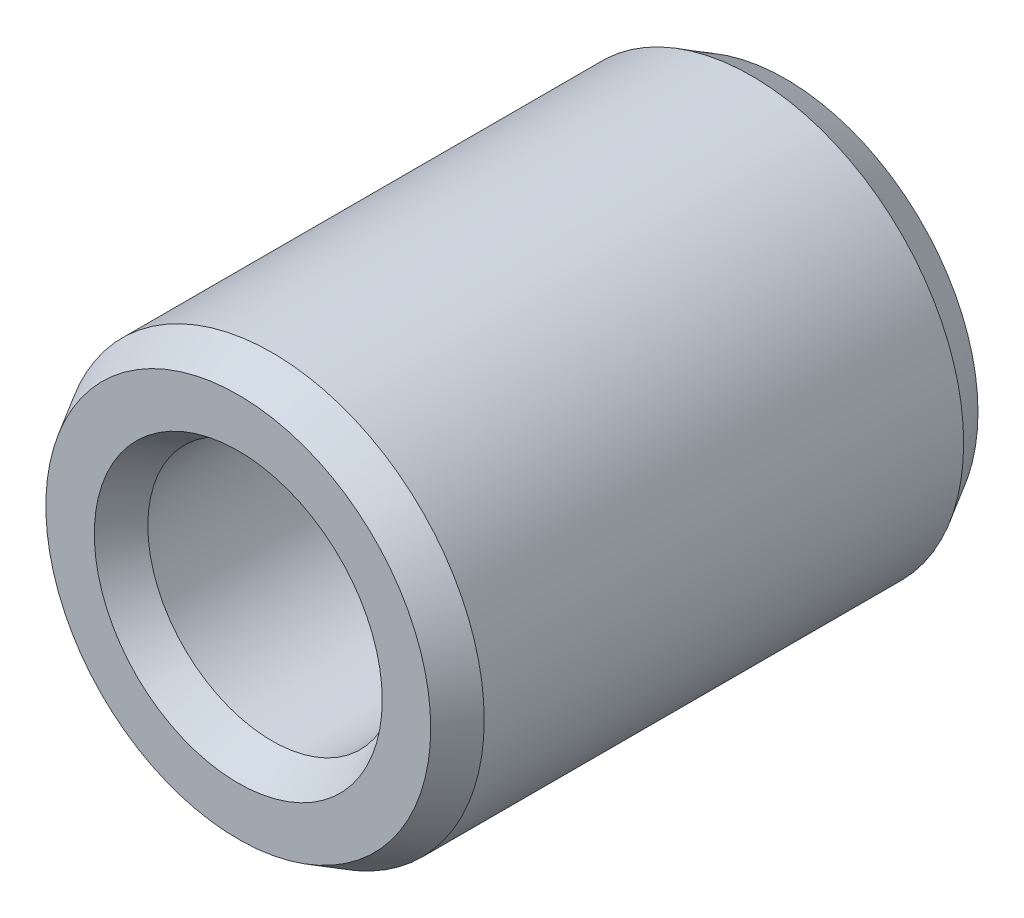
ISO-10303-21;
HEADER;
FILE_DESCRIPTION(('STEP AP214'),'2;1');
FILE_NAME('part.step','',(''),(''),'','','');
FILE_SCHEMA(('AUTOMOTIVE_DESIGN { 1 0 10303 214 1 1 1 1 }'));
ENDSEC;
DATA;
#1=APPLICATION_CONTEXT('core data for automotive mechanical design processes');
#2=APPLICATION_PROTOCOL_DEFINITION('international standard','automotive_design',2000,#1);
#3=PRODUCT_CONTEXT('',#1,'mechanical');
#4=PRODUCT('Part','Part','',(#3));
#5=PRODUCT_RELATED_PRODUCT_CATEGORY('part','',(#4));
#6=PRODUCT_DEFINITION_FORMATION('','',#4);
#7=PRODUCT_DEFINITION_CONTEXT('part definition',#1,'design');
#8=PRODUCT_DEFINITION('design','',#6,#7);
#9=PRODUCT_DEFINITION_SHAPE('','',#8);
#10=(LENGTH_UNIT() NAMED_UNIT(*) SI_UNIT(.MILLI.,.METRE.));
#11=(NAMED_UNIT(*) PLANE_ANGLE_UNIT() SI_UNIT($,.RADIAN.));
#12=(NAMED_UNIT(*) SI_UNIT($,.STERADIAN.) SOLID_ANGLE_UNIT());
#13=UNCERTAINTY_MEASURE_WITH_UNIT(LENGTH_MEASURE(1.E-05),#10,'distance_accuracy_value','');
#14=(GEOMETRIC_REPRESENTATION_CONTEXT(3) GLOBAL_UNCERTAINTY_ASSIGNED_CONTEXT((#13)) GLOBAL_UNIT_ASSIGNED_CONTEXT((#10,
#11,#12)) REPRESENTATION_CONTEXT('',''));
#15=CARTESIAN_POINT('',(0.,0.,0.));
#16=DIRECTION('',(0.,0.,1.));
#17=DIRECTION('',(1.,0.,0.));
#18=AXIS2_PLACEMENT_3D('',#15,#16,#17);
#19=CARTESIAN_POINT('',(0.,0.,12.2936));
#20=DIRECTION('',(0.,0.,1.));
#21=DIRECTION('',(1.,0.,0.));
#22=AXIS2_PLACEMENT_3D('',#19,#20,#21);
#23=PLANE('',#22);
#24=CARTESIAN_POINT('',(0.,0.,12.2936));
#25=DIRECTION('',(0.,0.,1.));
#26=DIRECTION('',(1.,0.,0.));
#27=AXIS2_PLACEMENT_3D('',#24,#25,#26);
#28=CIRCLE('',#27,3.2339409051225);
#29=CARTESIAN_POINT('',(3.2339409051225,0.,12.2936));
#30=VERTEX_POINT('',#29);
#31=EDGE_CURVE('E39',#30,#30,#28,.F.);
#32=ORIENTED_EDGE('',*,*,#31,.T.);
#33=EDGE_LOOP('',(#32));
#34=FACE_BOUND('',#33,.T.);
#35=CARTESIAN_POINT('',(0.,0.,12.2936));
#36=DIRECTION('',(0.,0.,1.));
#37=DIRECTION('',(1.,0.,0.));
#38=AXIS2_PLACEMENT_3D('',#35,#36,#37);
#39=CIRCLE('',#38,4.3225590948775);
#40=CARTESIAN_POINT('',(4.3225590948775,0.,12.2936));
#41=VERTEX_POINT('',#40);
#42=EDGE_CURVE('E43',#41,#41,#39,.T.);
#43=ORIENTED_EDGE('',*,*,#42,.T.);
#44=EDGE_LOOP('',(#43));
#45=FACE_BOUND('',#44,.T.);
#46=ADVANCED_FACE('F28',(#34,#45),#23,.T.);
#47=CARTESIAN_POINT('',(1.55431223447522E-12,1.11022302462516E-12,0.));
#48=DIRECTION('',(0.,0.,1.));
#49=DIRECTION('',(1.,0.,0.));
#50=AXIS2_PLACEMENT_3D('',#47,#48,#49);
#51=PLANE('',#50);
#52=CARTESIAN_POINT('',(1.55431223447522E-12,1.11022302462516E-12,0.));
#53=DIRECTION('',(0.,0.,1.));
#54=DIRECTION('',(1.,0.,0.));
#55=AXIS2_PLACEMENT_3D('',#52,#53,#54);
#56=CIRCLE('',#55,3.2339409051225);
#57=CARTESIAN_POINT('',(3.23394090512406,1.10583600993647E-12,0.));
#58=VERTEX_POINT('',#57);
#59=EDGE_CURVE('E54',#58,#58,#56,.T.);
#60=ORIENTED_EDGE('',*,*,#59,.T.);
#61=EDGE_LOOP('',(#60));
#62=FACE_BOUND('',#61,.T.);
#63=CARTESIAN_POINT('',(1.55431223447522E-12,1.11022302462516E-12,0.));
#64=DIRECTION('',(0.,0.,1.));
#65=DIRECTION('',(1.,0.,0.));
#66=AXIS2_PLACEMENT_3D('',#63,#64,#65);
#67=CIRCLE('',#66,4.3225590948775);
#68=CARTESIAN_POINT('',(4.32255909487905,1.1043592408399E-12,0.));
#69=VERTEX_POINT('',#68);
#70=EDGE_CURVE('E57',#69,#69,#67,.F.);
#71=ORIENTED_EDGE('',*,*,#70,.T.);
#72=EDGE_LOOP('',(#71));
#73=FACE_BOUND('',#72,.T.);
#74=ADVANCED_FACE('F61',(#62,#73),#51,.F.);
#75=CARTESIAN_POINT('',(0.,0.,12.2936));
#76=DIRECTION('',(0.,0.,-1.));
#77=DIRECTION('',(-1.,0.,0.));
#78=AXIS2_PLACEMENT_3D('',#75,#76,#77);
#79=CYLINDRICAL_SURFACE('',#78,4.7625);
#80=CARTESIAN_POINT('',(1.11022302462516E-12,0.,0.761999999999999));
#81=DIRECTION('',(0.,0.,1.));
#82=DIRECTION('',(1.,0.,0.));
#83=AXIS2_PLACEMENT_3D('',#80,#81,#82);
#84=CIRCLE('',#83,4.7625);
#85=CARTESIAN_POINT('',(4.76250000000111,0.,0.762000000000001));
#86=VERTEX_POINT('',#85);
#87=EDGE_CURVE('E10',#86,#86,#84,.T.);
#88=ORIENTED_EDGE('',*,*,#87,.T.);
#89=EDGE_LOOP('',(#88));
#90=FACE_BOUND('',#89,.T.);
#91=CARTESIAN_POINT('',(2.22044604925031E-13,1.11022302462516E-12,11.5316));
#92=DIRECTION('',(0.,0.,1.));
#93=DIRECTION('',(1.,0.,0.));
#94=AXIS2_PLACEMENT_3D('',#91,#92,#93);
#95=CIRCLE('',#94,4.7625);
#96=CARTESIAN_POINT('',(4.76250000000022,1.10376243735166E-12,11.5316));
#97=VERTEX_POINT('',#96);
#98=EDGE_CURVE('E35',#97,#97,#95,.F.);
#99=ORIENTED_EDGE('',*,*,#98,.T.);
#100=EDGE_LOOP('',(#99));
#101=FACE_BOUND('',#100,.T.);
#102=ADVANCED_FACE('F30',(#90,#101),#79,.T.);
#103=CARTESIAN_POINT('',(0.,0.,12.2936));
#104=DIRECTION('',(0.,0.,-1.));
#105=DIRECTION('',(-1.,0.,0.));
#106=AXIS2_PLACEMENT_3D('',#103,#104,#105);
#107=CYLINDRICAL_SURFACE('',#106,2.794);
#108=CARTESIAN_POINT('',(1.11022302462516E-12,0.,0.761999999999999));
#109=DIRECTION('',(0.,0.,1.));
#110=DIRECTION('',(1.,0.,0.));
#111=AXIS2_PLACEMENT_3D('',#108,#109,#110);
#112=CIRCLE('',#111,2.794);
#113=CARTESIAN_POINT('',(2.79400000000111,0.,0.762));
#114=VERTEX_POINT('',#113);
#115=EDGE_CURVE('E48',#114,#114,#112,.F.);
#116=ORIENTED_EDGE('',*,*,#115,.T.);
#117=EDGE_LOOP('',(#116));
#118=FACE_BOUND('',#117,.T.);
#119=CARTESIAN_POINT('',(2.22044604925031E-13,1.11022302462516E-12,11.5316));
#120=DIRECTION('',(0.,0.,1.));
#121=DIRECTION('',(1.,0.,0.));
#122=AXIS2_PLACEMENT_3D('',#119,#120,#121);
#123=CIRCLE('',#122,2.794);
#124=CARTESIAN_POINT('',(2.79400000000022,1.10643281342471E-12,11.5316));
#125=VERTEX_POINT('',#124);
#126=EDGE_CURVE('E51',#125,#125,#123,.T.);
#127=ORIENTED_EDGE('',*,*,#126,.T.);
#128=EDGE_LOOP('',(#127));
#129=FACE_BOUND('',#128,.T.);
#130=ADVANCED_FACE('F87',(#118,#129),#107,.F.);
#131=CARTESIAN_POINT('',(1.55431223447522E-12,1.11022302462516E-12,0.));
#132=DIRECTION('',(0.,0.,-1.));
#133=DIRECTION('',(-1.,0.,0.));
#134=AXIS2_PLACEMENT_3D('',#131,#132,#133);
#135=CONICAL_SURFACE('',#134,3.2339409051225,0.523598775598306);
#136=ORIENTED_EDGE('',*,*,#115,.F.);
#137=EDGE_LOOP('',(#136));
#138=FACE_BOUND('',#137,.T.);
#139=ORIENTED_EDGE('',*,*,#59,.F.);
#140=EDGE_LOOP('',(#139));
#141=FACE_BOUND('',#140,.T.);
#142=ADVANCED_FACE('F75',(#138,#141),#135,.F.);
#143=CARTESIAN_POINT('',(2.22044604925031E-13,1.11022302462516E-12,11.5316));
#144=DIRECTION('',(0.,0.,1.));
#145=DIRECTION('',(1.,0.,0.));
#146=AXIS2_PLACEMENT_3D('',#143,#144,#145);
#147=CONICAL_SURFACE('',#146,2.794,0.523598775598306);
#148=ORIENTED_EDGE('',*,*,#31,.F.);
#149=EDGE_LOOP('',(#148));
#150=FACE_BOUND('',#149,.T.);
#151=ORIENTED_EDGE('',*,*,#126,.F.);
#152=EDGE_LOOP('',(#151));
#153=FACE_BOUND('',#152,.T.);
#154=ADVANCED_FACE('F67',(#150,#153),#147,.F.);
#155=CARTESIAN_POINT('',(1.11022302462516E-12,0.,0.761999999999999));
#156=DIRECTION('',(0.,0.,1.));
#157=DIRECTION('',(1.,0.,0.));
#158=AXIS2_PLACEMENT_3D('',#155,#156,#157);
#159=CONICAL_SURFACE('',#158,4.7625,0.523598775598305);
#160=ORIENTED_EDGE('',*,*,#70,.F.);
#161=EDGE_LOOP('',(#160));
#162=FACE_BOUND('',#161,.T.);
#163=ORIENTED_EDGE('',*,*,#87,.F.);
#164=EDGE_LOOP('',(#163));
#165=FACE_BOUND('',#164,.T.);
#166=ADVANCED_FACE('F63',(#162,#165),#159,.T.);
#167=CARTESIAN_POINT('',(0.,0.,12.2936));
#168=DIRECTION('',(0.,0.,-1.));
#169=DIRECTION('',(-1.,0.,0.));
#170=AXIS2_PLACEMENT_3D('',#167,#168,#169);
#171=CONICAL_SURFACE('',#170,4.3225590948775,0.523598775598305);
#172=ORIENTED_EDGE('',*,*,#98,.F.);
#173=EDGE_LOOP('',(#172));
#174=FACE_BOUND('',#173,.T.);
#175=ORIENTED_EDGE('',*,*,#42,.F.);
#176=EDGE_LOOP('',(#175));
#177=FACE_BOUND('',#176,.T.);
#178=ADVANCED_FACE('F66',(#174,#177),#171,.T.);
#179=CLOSED_SHELL('',(#46,#74,#102,#130,#142,#154,#166,#178));
#180=MANIFOLD_SOLID_BREP('B2',#179);
#181=ADVANCED_BREP_SHAPE_REPRESENTATION('',(#18,#180),#14);
#182=SHAPE_DEFINITION_REPRESENTATION(#9,#181);
ENDSEC;
END-ISO-10303-21;
